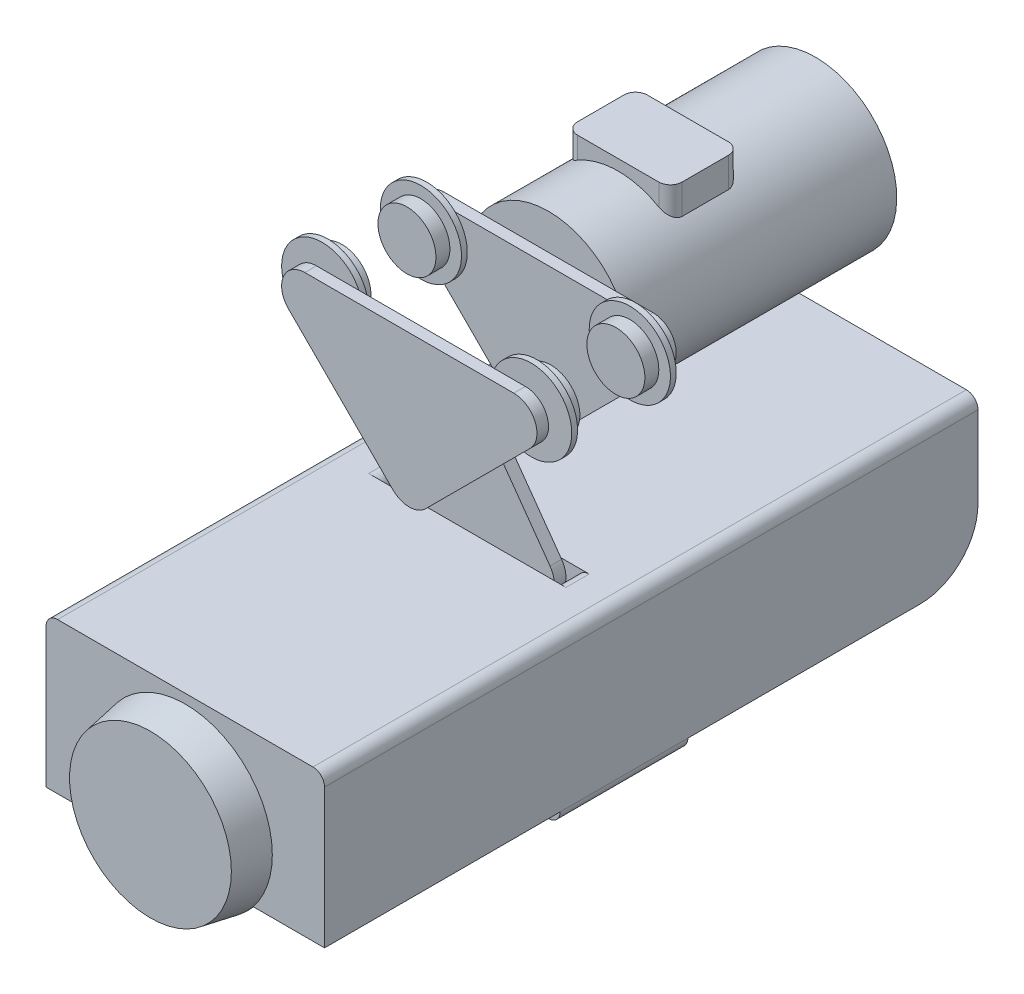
from build123d import *

# Parameters (mm, degrees)
BOSS_EXTRU_1_DEPTH  = 10
ESQUISSE3_R         = 10
BOSS_EXTRU_2_DEPTH  = 5
ESQUISSE4_R         = 35
BOSS_EXTRU_3_DEPTH  = 5
ESQUISSE5_R         = 25
BOSS_EXTRU_4_DEPTH  = 12
ESQUISSE6_R         = 15
BOSS_EXTRU_5_DEPTH  = 100
ESQUISSE7_R         = 70
BOSS_EXTRU_6_DEPTH  = 230
BOSS_EXTRU_7_DEPTH  = 5
BOSS_EXTRU_8_DEPTH  = 10
CONG_1_R            = 10
BOSS_EXTRU_9_START  = 50
BOSS_EXTRU_9_DEPTH  = 50
BOSS_EXTRU_10_DEPTH = 250
CONG_2_R            = 50
ESQUISSE12_R        = 75
BOSS_EXTRU_12_DEPTH = 250
ESQUISSE13_W        = 90
ESQUISSE13_H        = 60
BOSS_EXTRU_13_DEPTH = 30
CONG_3_R            = 10
BOSS_EXTRU_14_DEPTH = 40
BOSS_EXTRU_15_DEPTH = 40
BOSS_EXTRU_16_START = 200
BOSS_EXTRU_16_DEPTH = 200
BOSS_EXTRU_17_START = 3
BOSS_EXTRU_17_DEPTH = 3
BOSS_EXTRU_18_REACH = 670.21
ESQUISSE18_R        = 50
ESQUISSE19_R        = 75
BOSS_EXTRU_19_DEPTH = 30
BOSS_EXTRU_19_TAPER = 10


with BuildPart() as part:
    # Esquisse1 → Boss.-Extru.1 (new body)
    with BuildSketch(Plane.XY):
        with BuildLine():
            Line((-90, 0), (90, 0))
            ThreePointArc((90, 0), (108.47759065, -12.346331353), (104.142135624, -34.142135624))
            Line((104.142135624, -34.142135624), (14.142135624, -124.142135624))
            ThreePointArc((14.142135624, -124.142135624), (0, -130), (-14.142135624, -124.142135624))
            Line((-14.142135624, -124.142135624), (-104.142135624, -34.142135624))
            ThreePointArc((-104.142135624, -34.142135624), (-108.47759065, -12.346331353), (-90, 0))
        make_face()
    boss_extru_1 = extrude(amount=BOSS_EXTRU_1_DEPTH)

    # Esquisse3 → Boss.-Extru.2 (add)
    with BuildSketch(Plane(origin=(0, 0, 0), x_dir=(-1, 0, 0), z_dir=(0, 0, -1))):
        with Locations((-90, -20)):
            Circle(ESQUISSE3_R)
        with Locations((90, -20)):
            Circle(ESQUISSE3_R)
    boss_extru_2 = extrude(amount=BOSS_EXTRU_2_DEPTH)

    # Esquisse4 → Boss.-Extru.3 (add)
    with BuildSketch(Plane(origin=(0, 0, -5), x_dir=(-1, 0, 0), z_dir=(0, 0, -1))):
        with Locations((-90, -20)):
            Circle(ESQUISSE4_R)
        with Locations((90, -20)):
            Circle(ESQUISSE4_R)
    boss_extru_3 = extrude(amount=BOSS_EXTRU_3_DEPTH)

    # Esquisse5 → Boss.-Extru.4 (add)
    with BuildSketch(Plane(origin=(0, 0, -10), x_dir=(-1, 0, 0), z_dir=(0, 0, -1))):
        with Locations((-90, -20)):
            Circle(ESQUISSE5_R)
        with Locations((90, -20)):
            Circle(ESQUISSE5_R)
    boss_extru_4 = extrude(amount=BOSS_EXTRU_4_DEPTH)

    # Esquisse6 → Boss.-Extru.5 (add)
    with BuildSketch(Plane(origin=(0, 0, 0), x_dir=(-1, 0, 0), z_dir=(0, 0, -1))):
        with Locations((0, -110)):
            Circle(ESQUISSE6_R)
    extrude(amount=BOSS_EXTRU_5_DEPTH)

    # Sym_trie3: Boss.-Extru.1, Boss.-Extru.2, Boss.-Extru.3, Boss.-Extru.4 across plane
    add(boss_extru_1.mirror(Plane(origin=(0, 0, -50), x_dir=(1, 0, 0), z_dir=(0, 0, -1))))
    add(boss_extru_2.mirror(Plane(origin=(0, 0, -50), x_dir=(1, 0, 0), z_dir=(0, 0, -1))))
    add(boss_extru_3.mirror(Plane(origin=(0, 0, -50), x_dir=(1, 0, 0), z_dir=(0, 0, -1))))
    add(boss_extru_4.mirror(Plane(origin=(0, 0, -50), x_dir=(1, 0, 0), z_dir=(0, 0, -1))))

    # Esquisse7 → Boss.-Extru.6 (add)
    with BuildSketch(Plane(origin=(0, 0, -110), x_dir=(-1, 0, 0), z_dir=(0, 0, -1))):
        with Locations(Location((0, -39.289321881, 0), (0, 0, 145.855910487))):
            Circle(ESQUISSE7_R)
    extrude(amount=BOSS_EXTRU_6_DEPTH)

    # Esquisse8 → Boss.-Extru.7 (add, symmetric)
    with BuildSketch(Plane(origin=(0, 0, -50), x_dir=(-1, 0, 0), z_dir=(0, 0, -1))):
        with BuildLine():
            Line((-16.274669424, -98.375236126), (-66.274669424, -168.375236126))
            ThreePointArc((-66.274669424, -168.375236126), (-67.783352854, -189.151631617), (-50, -200))
            Line((-50, -200), (50, -200))
            ThreePointArc((50, -200), (67.783352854, -189.151631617), (66.274669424, -168.375236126))
            Line((66.274669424, -168.375236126), (16.274669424, -98.375236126))
            ThreePointArc((16.274669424, -98.375236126), (0, -90), (-16.274669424, -98.375236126))
        make_face()
    extrude(amount=BOSS_EXTRU_7_DEPTH, both=True)

    # Esquisse9 → Boss.-Extru.8 (add, symmetric)
    with BuildSketch(Plane(origin=(0, 0, -50), x_dir=(-1, 0, 0), z_dir=(0, 0, -1))):
        Polygon((-120, -172.460811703), (-75, -172.460811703), (-75, -197.024908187), (75, -197.024908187), (75, -172.460811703), (120, -172.460811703), (120, -312.460811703), (-120, -312.460811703), align=None)
    extrude(amount=BOSS_EXTRU_8_DEPTH, both=True)

    # Cong_1
    cong_1_edges = [part.edges().sort_by_distance(p)[0] for p in [
        (-75, -197.024908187, -50),
        (120, -172.460811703, -50),
        (120, -312.460811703, -50),
        (-120, -312.460811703, -50),
        (-120, -172.460811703, -50),
        (-75, -172.460811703, -50),
        (75, -197.024908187, -50),
        (75, -172.460811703, -50),
    ]]
    fillet(cong_1_edges, radius=CONG_1_R)

    # Esquisse10 → Boss.-Extru.9 (add)
    with BuildSketch(Plane(origin=(0, 0, -60), x_dir=(-1, 0, 0), z_dir=(0, 0, -1)).offset(BOSS_EXTRU_9_START)):
        with BuildLine():
            Line((-120, -182.460811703), (-120, -302.460811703))
            ThreePointArc((-120, -302.460811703), (-117.071067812, -309.531879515), (-110, -312.460811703))
            Line((-110, -312.460811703), (110, -312.460811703))
            ThreePointArc((110, -312.460811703), (117.071067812, -309.531879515), (120, -302.460811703))
            Line((120, -302.460811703), (120, -182.460811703))
            ThreePointArc((120, -182.460811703), (117.071067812, -175.389743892), (110, -172.460811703))
            Line((110, -172.460811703), (-110, -172.460811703))
            ThreePointArc((-110, -172.460811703), (-117.071067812, -175.389743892), (-120, -182.460811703))
        make_face()
    extrude(amount=-BOSS_EXTRU_9_DEPTH)

    # Esquisse11 → Boss.-Extru.10 (add)
    with BuildSketch(Plane(origin=(0, 0, -110), x_dir=(-1, 0, 0), z_dir=(0, 0, -1))):
        with BuildLine():
            Line((-120, -182.460811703), (-120, -302.460811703))
            Line((-120, -302.460811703), (-117, -302.460811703))
            Line((-117, -302.460811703), (-117, -182.460811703))
            ThreePointArc((-117, -182.460811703), (-114.949747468, -177.511064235), (-110, -175.460811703))
            Line((-110, -175.460811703), (110, -175.460811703))
            ThreePointArc((110, -175.460811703), (114.949747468, -177.511064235), (117, -182.460811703))
            Line((117, -182.460811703), (117, -302.460811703))
            Line((117, -302.460811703), (120, -302.460811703))
            Line((120, -302.460811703), (120, -182.460811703))
            ThreePointArc((120, -182.460811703), (117.071067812, -175.389743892), (110, -172.460811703))
            Line((110, -172.460811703), (-110, -172.460811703))
            ThreePointArc((-110, -172.460811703), (-117.071067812, -175.389743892), (-120, -182.460811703))
        make_face()
    extrude(amount=BOSS_EXTRU_10_DEPTH)

    # Cong_2
    cong_2_edges = [part.edges().sort_by_distance(p)[0] for p in [
        (118.5, -302.460811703, -360),
        (-118.5, -302.460811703, -360),
    ]]
    fillet(cong_2_edges, radius=CONG_2_R)

    # Esquisse12 → Boss.-Extru.12 (add)
    with BuildSketch(Plane(origin=(0, 0, -110), x_dir=(-1, 0, 0), z_dir=(0, 0, -1))):
        with Locations(Location((0, -255.460811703, 0), (0, 0, 229.464197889))):
            Circle(ESQUISSE12_R)
    extrude(amount=BOSS_EXTRU_12_DEPTH)

    # Esquisse13 → Boss.-Extru.13 (add)
    with BuildSketch(Plane.XZ.offset(312.460811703)):
        with Locations((0, -200)):
            Rectangle(ESQUISSE13_W, ESQUISSE13_H)
    extrude(amount=BOSS_EXTRU_13_DEPTH)

    # Cong_3
    cong_3_edges = [part.edges().sort_by_distance(p)[0] for p in [
        (-45, -328.960811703, -170),
        (-45, -328.960811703, -230),
        (45, -328.960811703, -230),
        (45, -328.960811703, -170),
    ]]
    fillet(cong_3_edges, radius=CONG_3_R)

    # Esquisse14 → Boss.-Extru.14 (add)
    with BuildSketch(Plane(origin=(0, 0, 0), x_dir=(1, 0, 0), z_dir=(0, 1, 0))):
        with BuildLine():
            Line((-35, 230), (35, 230))
            ThreePointArc((35, 230), (42.071067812, 227.071067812), (45, 220))
            Line((45, 220), (45, 180))
            ThreePointArc((45, 180), (42.071067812, 172.928932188), (35, 170))
            Line((35, 170), (-35, 170))
            ThreePointArc((-35, 170), (-42.071067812, 172.928932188), (-45, 180))
            Line((-45, 180), (-45, 220))
            ThreePointArc((-45, 220), (-42.071067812, 227.071067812), (-35, 230))
        make_face()
    extrude(amount=BOSS_EXTRU_14_DEPTH)

    # Esquisse15 → Boss.-Extru.15 (add)
    with BuildSketch(Plane.XY.offset(-40)):
        with BuildLine():
            Line((-120, -302.460811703), (-120, -182.460811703))
            ThreePointArc((-120, -182.460811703), (-117.071067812, -175.389743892), (-110, -172.460811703))
            Line((-110, -172.460811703), (110, -172.460811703))
            ThreePointArc((110, -172.460811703), (117.071067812, -175.389743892), (120, -182.460811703))
            Line((120, -182.460811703), (120, -302.460811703))
            ThreePointArc((120, -302.460811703), (117.071067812, -309.531879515), (110, -312.460811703))
            Line((110, -312.460811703), (-110, -312.460811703))
            ThreePointArc((-110, -312.460811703), (-117.071067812, -309.531879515), (-120, -302.460811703))
        make_face()
    extrude(amount=BOSS_EXTRU_15_DEPTH)

    # Esquisse16 → Boss.-Extru.16 (add)
    with BuildSketch(Plane.XY.offset(BOSS_EXTRU_16_START)):
        with BuildLine():
            Line((-120, -182.460811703), (-120, -302.460811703))
            Line((-120, -302.460811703), (-117, -302.460811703))
            Line((-117, -302.460811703), (-117, -182.460811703))
            ThreePointArc((-117, -182.460811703), (-114.949747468, -177.511064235), (-110, -175.460811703))
            Line((-110, -175.460811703), (110, -175.460811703))
            ThreePointArc((110, -175.460811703), (114.949747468, -177.511064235), (117, -182.460811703))
            Line((117, -182.460811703), (117, -302.460811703))
            Line((117, -302.460811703), (120, -302.460811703))
            Line((120, -302.460811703), (120, -182.460811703))
            ThreePointArc((120, -182.460811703), (117.071067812, -175.389743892), (110, -172.460811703))
            Line((110, -172.460811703), (-110, -172.460811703))
            ThreePointArc((-110, -172.460811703), (-117.071067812, -175.389743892), (-120, -182.460811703))
        make_face()
    extrude(amount=-BOSS_EXTRU_16_DEPTH)

    # Esquisse17 → Boss.-Extru.17 (add)
    with BuildSketch(Plane.XY.offset(200).offset(BOSS_EXTRU_17_START)):
        with BuildLine():
            Line((-120, -182.460811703), (-120, -302.460811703))
            Line((-120, -302.460811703), (-58.446556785, -302.460811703))
            ThreePointArc((-58.446556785, -302.460811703), (0, -330.460811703), (58.446556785, -302.460811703))
            Line((58.446556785, -302.460811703), (120, -302.460811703))
            Line((120, -302.460811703), (120, -182.460811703))
            ThreePointArc((120, -182.460811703), (117.071067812, -175.389743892), (110, -172.460811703))
            Line((110, -172.460811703), (-110, -172.460811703))
            ThreePointArc((-110, -172.460811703), (-117.071067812, -175.389743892), (-120, -182.460811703))
        make_face()
    extrude(amount=-BOSS_EXTRU_17_DEPTH)

    # Esquisse18 → Boss.-Extru.18 (add, up to next)
    with BuildSketch(Plane(origin=(0, 0, 200), x_dir=(-1, 0, 0), z_dir=(0, 0, -1)), mode=Mode.PRIVATE) as boss_extru_18_sk1:
        with Locations(Location((0, -255.460811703, 0), (0, 0, 180))):
            Circle(ESQUISSE18_R)
    boss_extru_18_tool1 = extrude(boss_extru_18_sk1.sketch, amount=BOSS_EXTRU_18_REACH, mode=Mode.PRIVATE) - part.part
    add(boss_extru_18_tool1.solids().sort_by_distance((0, -255.460812, 200))[0])

    # Esquisse19 → Boss.-Extru.19 (add)
    with BuildSketch(Plane.XY.offset(203)):
        with Locations(Location((0, -255.460811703, 0), (0, 0, 310.535802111))):
            Circle(ESQUISSE19_R)
    extrude(amount=BOSS_EXTRU_19_DEPTH, taper=BOSS_EXTRU_19_TAPER)


solid = part.part
